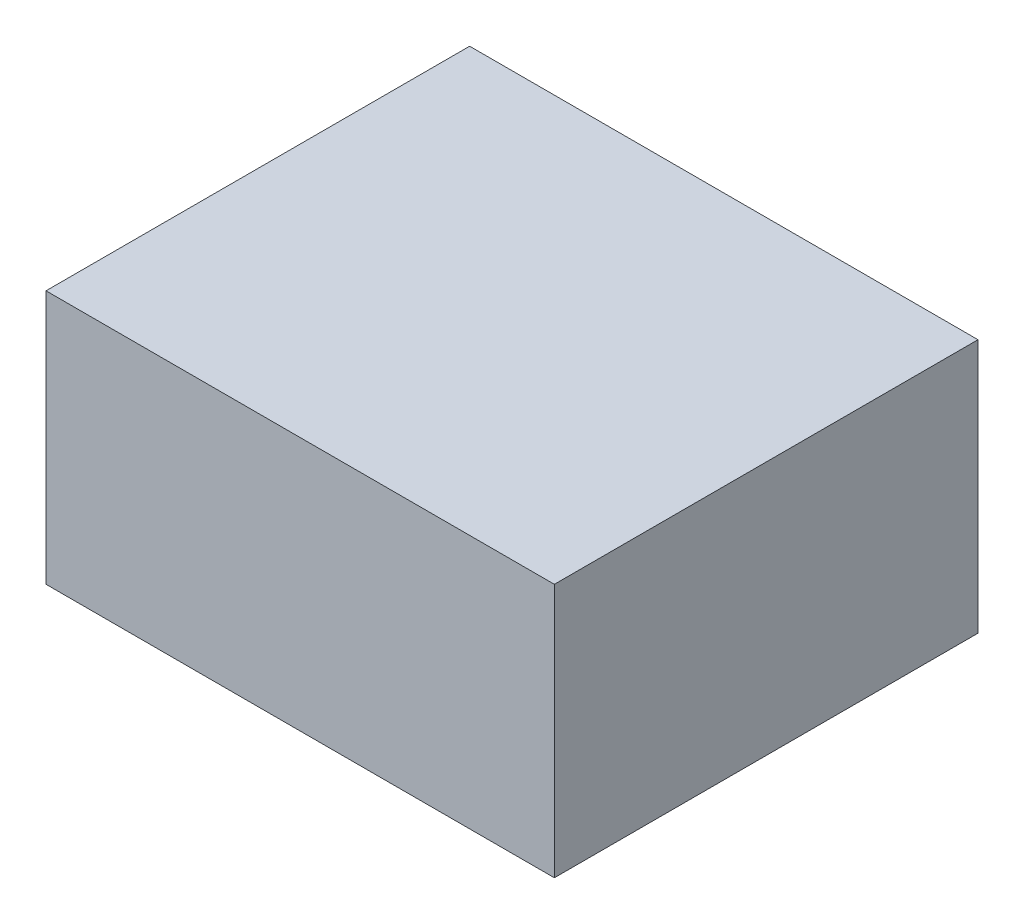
ISO-10303-21;
HEADER;
FILE_DESCRIPTION(('STEP AP214'),'2;1');
FILE_NAME('part.step','',(''),(''),'','','');
FILE_SCHEMA(('AUTOMOTIVE_DESIGN { 1 0 10303 214 1 1 1 1 }'));
ENDSEC;
DATA;
#1=APPLICATION_CONTEXT('core data for automotive mechanical design processes');
#2=APPLICATION_PROTOCOL_DEFINITION('international standard','automotive_design',2000,#1);
#3=PRODUCT_CONTEXT('',#1,'mechanical');
#4=PRODUCT('Part','Part','',(#3));
#5=PRODUCT_RELATED_PRODUCT_CATEGORY('part','',(#4));
#6=PRODUCT_DEFINITION_FORMATION('','',#4);
#7=PRODUCT_DEFINITION_CONTEXT('part definition',#1,'design');
#8=PRODUCT_DEFINITION('design','',#6,#7);
#9=PRODUCT_DEFINITION_SHAPE('','',#8);
#10=(LENGTH_UNIT() NAMED_UNIT(*) SI_UNIT(.MILLI.,.METRE.));
#11=(NAMED_UNIT(*) PLANE_ANGLE_UNIT() SI_UNIT($,.RADIAN.));
#12=(NAMED_UNIT(*) SI_UNIT($,.STERADIAN.) SOLID_ANGLE_UNIT());
#13=UNCERTAINTY_MEASURE_WITH_UNIT(LENGTH_MEASURE(1.E-05),#10,'distance_accuracy_value','');
#14=(GEOMETRIC_REPRESENTATION_CONTEXT(3) GLOBAL_UNCERTAINTY_ASSIGNED_CONTEXT((#13)) GLOBAL_UNIT_ASSIGNED_CONTEXT((#10,
#11,#12)) REPRESENTATION_CONTEXT('',''));
#15=CARTESIAN_POINT('',(0.,0.,0.));
#16=DIRECTION('',(0.,0.,1.));
#17=DIRECTION('',(1.,0.,0.));
#18=AXIS2_PLACEMENT_3D('',#15,#16,#17);
#19=CARTESIAN_POINT('',(0.381,-0.1905,0.));
#20=DIRECTION('',(0.,-1.,0.));
#21=DIRECTION('',(0.,0.,-1.));
#22=AXIS2_PLACEMENT_3D('',#19,#20,#21);
#23=PLANE('',#22);
#24=DIRECTION('',(0.,0.,1.));
#25=VECTOR('',#24,1.);
#26=CARTESIAN_POINT('',(-0.381,-0.1905,0.));
#27=LINE('',#26,#25);
#28=CARTESIAN_POINT('',(-0.381,-0.1905,0.));
#29=VERTEX_POINT('',#28);
#30=CARTESIAN_POINT('',(-0.381,-0.1905,0.635));
#31=VERTEX_POINT('',#30);
#32=EDGE_CURVE('E20',#29,#31,#27,.T.);
#33=ORIENTED_EDGE('',*,*,#32,.F.);
#34=DIRECTION('',(1.,0.,0.));
#35=VECTOR('',#34,1.);
#36=CARTESIAN_POINT('',(-0.381,-0.1905,0.));
#37=LINE('',#36,#35);
#38=CARTESIAN_POINT('',(0.381,-0.1905,0.));
#39=VERTEX_POINT('',#38);
#40=EDGE_CURVE('E79',#29,#39,#37,.T.);
#41=ORIENTED_EDGE('',*,*,#40,.T.);
#42=DIRECTION('',(0.,0.,-1.));
#43=VECTOR('',#42,1.);
#44=CARTESIAN_POINT('',(0.381,-0.1905,0.));
#45=LINE('',#44,#43);
#46=CARTESIAN_POINT('',(0.381,-0.1905,0.635));
#47=VERTEX_POINT('',#46);
#48=EDGE_CURVE('E61',#47,#39,#45,.T.);
#49=ORIENTED_EDGE('',*,*,#48,.F.);
#50=DIRECTION('',(1.,0.,0.));
#51=VECTOR('',#50,1.);
#52=CARTESIAN_POINT('',(-0.381,-0.1905,0.635));
#53=LINE('',#52,#51);
#54=EDGE_CURVE('E56',#31,#47,#53,.T.);
#55=ORIENTED_EDGE('',*,*,#54,.F.);
#56=EDGE_LOOP('',(#33,#41,#49,#55));
#57=FACE_BOUND('',#56,.T.);
#58=ADVANCED_FACE('F17',(#57),#23,.T.);
#59=CARTESIAN_POINT('',(-0.381,-0.1905,0.));
#60=DIRECTION('',(-1.,0.,0.));
#61=DIRECTION('',(0.,0.,1.));
#62=AXIS2_PLACEMENT_3D('',#59,#60,#61);
#63=PLANE('',#62);
#64=DIRECTION('',(0.,0.,1.));
#65=VECTOR('',#64,1.);
#66=CARTESIAN_POINT('',(-0.381,0.1905,0.));
#67=LINE('',#66,#65);
#68=CARTESIAN_POINT('',(-0.381,0.1905,0.));
#69=VERTEX_POINT('',#68);
#70=CARTESIAN_POINT('',(-0.381,0.1905,0.635));
#71=VERTEX_POINT('',#70);
#72=EDGE_CURVE('E83',#69,#71,#67,.T.);
#73=ORIENTED_EDGE('',*,*,#72,.F.);
#74=DIRECTION('',(0.,1.,0.));
#75=VECTOR('',#74,1.);
#76=CARTESIAN_POINT('',(-0.381,-0.1905,0.));
#77=LINE('',#76,#75);
#78=EDGE_CURVE('E68',#69,#29,#77,.F.);
#79=ORIENTED_EDGE('',*,*,#78,.T.);
#80=ORIENTED_EDGE('',*,*,#32,.T.);
#81=DIRECTION('',(0.,1.,0.));
#82=VECTOR('',#81,1.);
#83=CARTESIAN_POINT('',(-0.381,-0.1905,0.635));
#84=LINE('',#83,#82);
#85=EDGE_CURVE('E63',#71,#31,#84,.F.);
#86=ORIENTED_EDGE('',*,*,#85,.F.);
#87=EDGE_LOOP('',(#73,#79,#80,#86));
#88=FACE_BOUND('',#87,.T.);
#89=ADVANCED_FACE('F65',(#88),#63,.T.);
#90=CARTESIAN_POINT('',(-0.381,-0.1905,0.635));
#91=DIRECTION('',(0.,0.,1.));
#92=DIRECTION('',(1.,0.,0.));
#93=AXIS2_PLACEMENT_3D('',#90,#91,#92);
#94=PLANE('',#93);
#95=DIRECTION('',(1.,0.,0.));
#96=VECTOR('',#95,1.);
#97=CARTESIAN_POINT('',(-0.381,0.1905,0.635));
#98=LINE('',#97,#96);
#99=CARTESIAN_POINT('',(0.381,0.1905,0.635));
#100=VERTEX_POINT('',#99);
#101=EDGE_CURVE('E72',#71,#100,#98,.T.);
#102=ORIENTED_EDGE('',*,*,#101,.F.);
#103=ORIENTED_EDGE('',*,*,#85,.T.);
#104=ORIENTED_EDGE('',*,*,#54,.T.);
#105=DIRECTION('',(0.,1.,0.));
#106=VECTOR('',#105,1.);
#107=CARTESIAN_POINT('',(0.381,0.1905,0.635));
#108=LINE('',#107,#106);
#109=EDGE_CURVE('E74',#100,#47,#108,.F.);
#110=ORIENTED_EDGE('',*,*,#109,.F.);
#111=EDGE_LOOP('',(#102,#103,#104,#110));
#112=FACE_BOUND('',#111,.T.);
#113=ADVANCED_FACE('F70',(#112),#94,.T.);
#114=CARTESIAN_POINT('',(0.381,0.1905,0.));
#115=DIRECTION('',(1.,0.,0.));
#116=DIRECTION('',(0.,0.,-1.));
#117=AXIS2_PLACEMENT_3D('',#114,#115,#116);
#118=PLANE('',#117);
#119=ORIENTED_EDGE('',*,*,#48,.T.);
#120=DIRECTION('',(0.,1.,0.));
#121=VECTOR('',#120,1.);
#122=CARTESIAN_POINT('',(0.381,-0.1905,0.));
#123=LINE('',#122,#121);
#124=CARTESIAN_POINT('',(0.381,0.1905,0.));
#125=VERTEX_POINT('',#124);
#126=EDGE_CURVE('E35',#39,#125,#123,.T.);
#127=ORIENTED_EDGE('',*,*,#126,.T.);
#128=DIRECTION('',(0.,0.,1.));
#129=VECTOR('',#128,1.);
#130=CARTESIAN_POINT('',(0.381,0.1905,0.));
#131=LINE('',#130,#129);
#132=EDGE_CURVE('E26',#100,#125,#131,.F.);
#133=ORIENTED_EDGE('',*,*,#132,.F.);
#134=ORIENTED_EDGE('',*,*,#109,.T.);
#135=EDGE_LOOP('',(#119,#127,#133,#134));
#136=FACE_BOUND('',#135,.T.);
#137=ADVANCED_FACE('F89',(#136),#118,.T.);
#138=CARTESIAN_POINT('',(-0.381,-0.1905,0.));
#139=DIRECTION('',(0.,0.,1.));
#140=DIRECTION('',(1.,0.,0.));
#141=AXIS2_PLACEMENT_3D('',#138,#139,#140);
#142=PLANE('',#141);
#143=DIRECTION('',(1.,0.,0.));
#144=VECTOR('',#143,1.);
#145=CARTESIAN_POINT('',(-0.381,0.1905,0.));
#146=LINE('',#145,#144);
#147=EDGE_CURVE('E11',#125,#69,#146,.F.);
#148=ORIENTED_EDGE('',*,*,#147,.F.);
#149=ORIENTED_EDGE('',*,*,#126,.F.);
#150=ORIENTED_EDGE('',*,*,#40,.F.);
#151=ORIENTED_EDGE('',*,*,#78,.F.);
#152=EDGE_LOOP('',(#148,#149,#150,#151));
#153=FACE_BOUND('',#152,.T.);
#154=ADVANCED_FACE('F91',(#153),#142,.F.);
#155=CARTESIAN_POINT('',(-0.381,0.1905,0.));
#156=DIRECTION('',(0.,1.,0.));
#157=DIRECTION('',(0.,0.,1.));
#158=AXIS2_PLACEMENT_3D('',#155,#156,#157);
#159=PLANE('',#158);
#160=ORIENTED_EDGE('',*,*,#132,.T.);
#161=ORIENTED_EDGE('',*,*,#147,.T.);
#162=ORIENTED_EDGE('',*,*,#72,.T.);
#163=ORIENTED_EDGE('',*,*,#101,.T.);
#164=EDGE_LOOP('',(#160,#161,#162,#163));
#165=FACE_BOUND('',#164,.T.);
#166=ADVANCED_FACE('F88',(#165),#159,.T.);
#167=CLOSED_SHELL('',(#58,#89,#113,#137,#154,#166));
#168=MANIFOLD_SOLID_BREP('B1',#167);
#169=ADVANCED_BREP_SHAPE_REPRESENTATION('',(#18,#168),#14);
#170=SHAPE_DEFINITION_REPRESENTATION(#9,#169);
ENDSEC;
END-ISO-10303-21;
